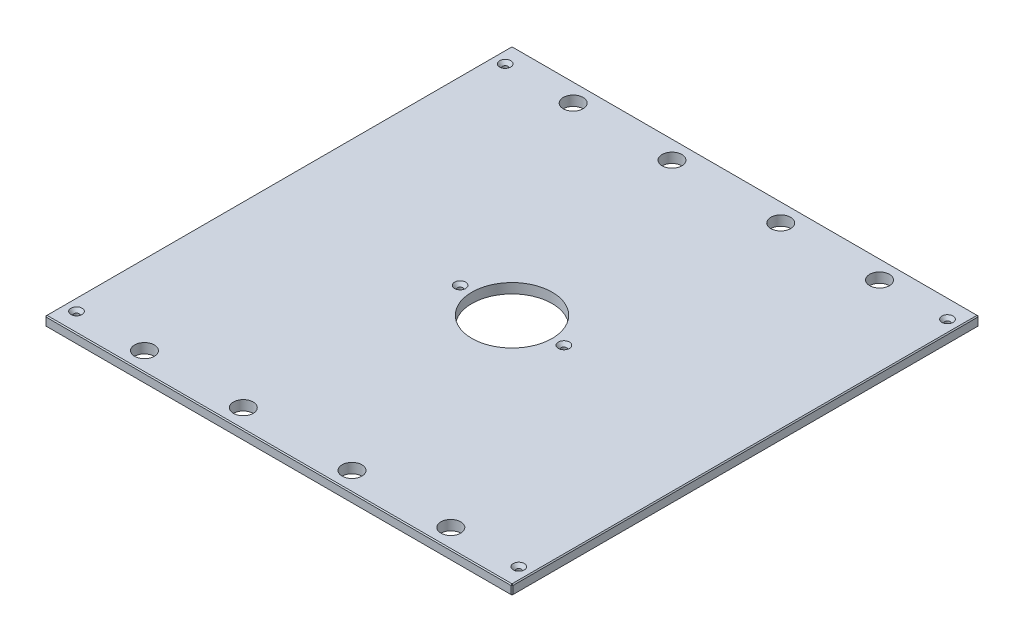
from build123d import *

# Parameters (mm, degrees)
SKETCH1_W                                        = 600.075
SKETCH1_H                                        = 600.075
BOSS_EXTRUDE1_DEPTH                              = 12.7
SKETCH13_R                                       = 51.562
CUT_EXTRUDE6_DEPTH                               = 425.507117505
F_1_1_DIAMETER_HOLE1_D                           = 25.4
CHAMFER2_SIZE                                    = 1.27
CSK_FOR_1_4_FLAT_HEAD_MACHINE_SCREW1_D           = 6.7564
CSK_FOR_1_4_FLAT_HEAD_MACHINE_SCREW1_CSINK_D     = 14.2748
CSK_FOR_1_4_FLAT_HEAD_MACHINE_SCREW1_CSINK_ANGLE = 82


with BuildPart() as part:
    # Sketch1 → Boss-Extrude1 (new body)
    with BuildSketch(Plane(origin=(0, 0, 0), x_dir=(1, 0, 0), z_dir=(0, 1, 0))):
        Rectangle(SKETCH1_W, SKETCH1_H)
    extrude(amount=BOSS_EXTRUDE1_DEPTH)

    # Sketch13 → Cut-Extrude6 (cut, through all)
    with BuildSketch(Plane(origin=(0, 12.7, 0), x_dir=(1, 0, 0), z_dir=(0, 1, 0))):
        with Locations(Location((0, 0, 0), (0, 0, 270))):
            Circle(SKETCH13_R)
    extrude(amount=-CUT_EXTRUDE6_DEPTH, mode=Mode.SUBTRACT)

    # 1 _1_ Diameter Hole1 (through all)
    with Locations(Plane(origin=(0, 12.7, 0), x_dir=(1, 0, 0), z_dir=(0, 1, 0))):
        with Locations((196.85, 275.42998), (-196.85, 275.42998), (196.85, -275.42998), (-196.85, -275.42998), (-69.85, 275.42998), (69.85, 275.42998), (69.85, -275.42998), (-69.85, -275.42998)):
            Hole(F_1_1_DIAMETER_HOLE1_D / 2)

    # Chamfer2
    chamfer2_edges = [part.edges().sort_by_distance(p)[0] for p in [
        (300.0375, 12.7, 0),
        (0, 12.7, -300.0375),
        (-300.0375, 12.7, 0),
        (0, 0, -300.0375),
        (300.0375, 0, 0),
        (0, 0, 300.0375),
        (-300.0375, 0, 0),
        (0, 12.7, 300.0375),
        (-300.0375, 6.35, -300.0375),
        (300.0375, 6.35, -300.0375),
        (300.0375, 6.35, 300.0375),
        (-300.0375, 6.35, 300.0375),
    ]]
    chamfer(chamfer2_edges, length=CHAMFER2_SIZE)

    # CSK for 1_4 Flat Head Machine Screw1 (through all)
    with Locations(Plane(origin=(0, 12.7, 0), x_dir=(1, 0, 0), z_dir=(0, 1, 0))):
        with Locations((284.1625, 275.42998), (284.1625, -275.42998), (-284.1625, -275.42998), (-66.675, 0), (66.675, 0), (-284.1625, 275.42998), (-196.85, 275.42998), (-196.85, -275.42998)):
            CounterSinkHole(CSK_FOR_1_4_FLAT_HEAD_MACHINE_SCREW1_D / 2, CSK_FOR_1_4_FLAT_HEAD_MACHINE_SCREW1_CSINK_D / 2, counter_sink_angle=CSK_FOR_1_4_FLAT_HEAD_MACHINE_SCREW1_CSINK_ANGLE)


solid = part.part
